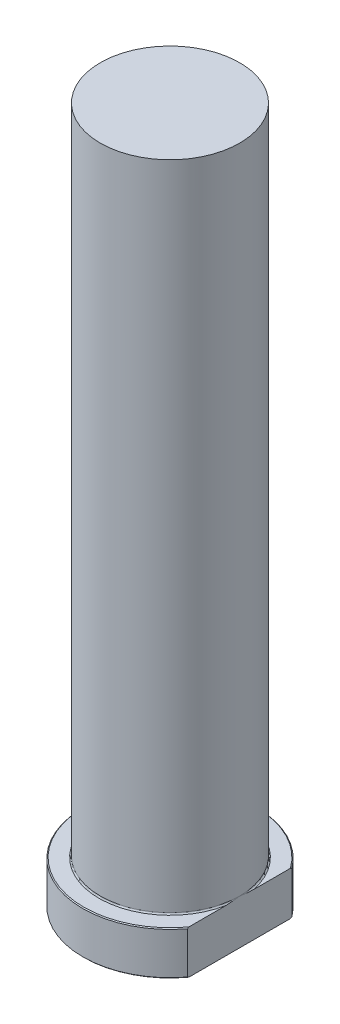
from build123d import *
from build123d.topology import SkipClean

# Parameters (mm, degrees)
CHAMFER1_SIZE = 0.2
FILLET1_R     = 0.3
KEY_DEPTH     = 163.480768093


with BuildPart() as part:
    # Sketch1 → Revolve1 (revolve)
    with BuildSketch(Plane.XY, mode=Mode.PRIVATE) as revolve1_sk:
        Polygon((0, 0), (-20, 0), (-20, 10), (-16, 10), (-16, 160), (0, 160), align=None)
    revolve(revolve1_sk.sketch.rotate(Axis((0, 259.958771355, 0), (0, -1, 0)), 270), axis=Axis((0, 259.958771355, 0), (0, -1, 0)))

    # Chamfer1
    chamfer1_edges = [part.edges().sort_by_distance(p)[0] for p in [
        (0, 10, -20),
        (0, 0, -20),
    ]]
    chamfer(chamfer1_edges, length=CHAMFER1_SIZE)

    # Fillet1
    fillet1_edges = [part.edges().sort_by_distance(p)[0] for p in [
        (0, 10, -16),
    ]]
    fillet(fillet1_edges, radius=FILLET1_R)

    # Sketch2 → KEY (cut, through all)
    with SkipClean():  # the faces are left unmerged after this step: merging them gives an invalid solid
        with BuildSketch(Plane(origin=(0, 0, 0), x_dir=(1, 0, 0), z_dir=(0, 1, 0))):
            with BuildLine():
                Line((16, 12), (16, -12))
                ThreePointArc((16, -12), (20, 0), (16, 12))
            make_face()
        extrude(amount=KEY_DEPTH, mode=Mode.SUBTRACT)


solid = part.part
